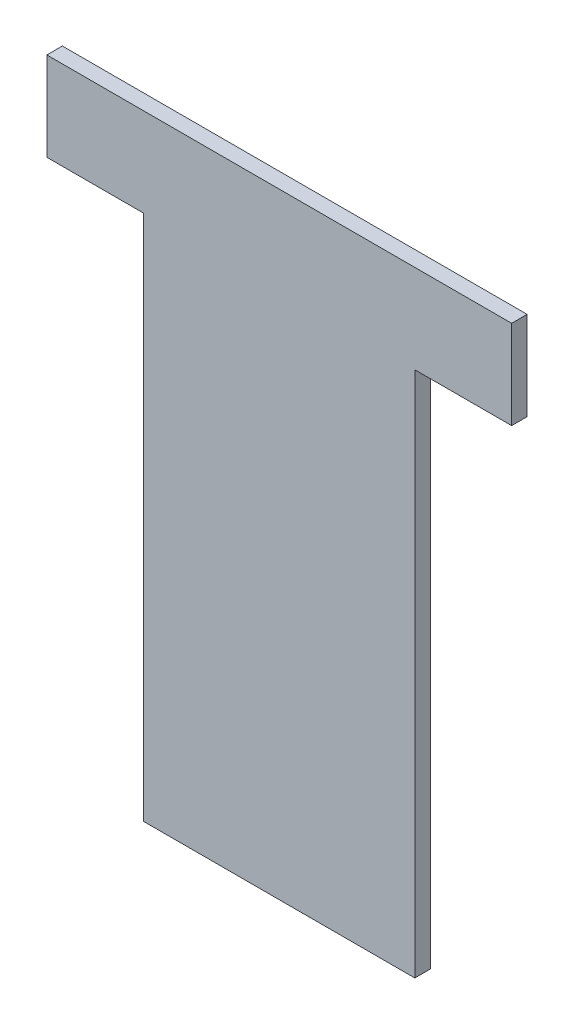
ISO-10303-21;
HEADER;
FILE_DESCRIPTION(('STEP AP214'),'2;1');
FILE_NAME('part.step','',(''),(''),'','','');
FILE_SCHEMA(('AUTOMOTIVE_DESIGN { 1 0 10303 214 1 1 1 1 }'));
ENDSEC;
DATA;
#1=APPLICATION_CONTEXT('core data for automotive mechanical design processes');
#2=APPLICATION_PROTOCOL_DEFINITION('international standard','automotive_design',2000,#1);
#3=PRODUCT_CONTEXT('',#1,'mechanical');
#4=PRODUCT('Part','Part','',(#3));
#5=PRODUCT_RELATED_PRODUCT_CATEGORY('part','',(#4));
#6=PRODUCT_DEFINITION_FORMATION('','',#4);
#7=PRODUCT_DEFINITION_CONTEXT('part definition',#1,'design');
#8=PRODUCT_DEFINITION('design','',#6,#7);
#9=PRODUCT_DEFINITION_SHAPE('','',#8);
#10=(LENGTH_UNIT() NAMED_UNIT(*) SI_UNIT(.MILLI.,.METRE.));
#11=(NAMED_UNIT(*) PLANE_ANGLE_UNIT() SI_UNIT($,.RADIAN.));
#12=(NAMED_UNIT(*) SI_UNIT($,.STERADIAN.) SOLID_ANGLE_UNIT());
#13=UNCERTAINTY_MEASURE_WITH_UNIT(LENGTH_MEASURE(1.E-05),#10,'distance_accuracy_value','');
#14=(GEOMETRIC_REPRESENTATION_CONTEXT(3) GLOBAL_UNCERTAINTY_ASSIGNED_CONTEXT((#13)) GLOBAL_UNIT_ASSIGNED_CONTEXT((#10,
#11,#12)) REPRESENTATION_CONTEXT('',''));
#15=CARTESIAN_POINT('',(0.,0.,0.));
#16=DIRECTION('',(0.,0.,1.));
#17=DIRECTION('',(1.,0.,0.));
#18=AXIS2_PLACEMENT_3D('',#15,#16,#17);
#19=CARTESIAN_POINT('',(-124.148712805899,86.4367353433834,5.));
#20=DIRECTION('',(1.,0.,0.));
#21=DIRECTION('',(0.,0.,-1.));
#22=AXIS2_PLACEMENT_3D('',#19,#20,#21);
#23=PLANE('',#22);
#24=DIRECTION('',(0.,-1.,0.));
#25=VECTOR('',#24,1.);
#26=CARTESIAN_POINT('',(-124.148712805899,86.4367353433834,0.));
#27=LINE('',#26,#25);
#28=CARTESIAN_POINT('',(-124.148712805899,115.046077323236,0.));
#29=VERTEX_POINT('',#28);
#30=CARTESIAN_POINT('',(-124.148712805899,86.4367353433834,0.));
#31=VERTEX_POINT('',#30);
#32=EDGE_CURVE('E129',#29,#31,#27,.T.);
#33=ORIENTED_EDGE('',*,*,#32,.T.);
#34=DIRECTION('',(0.,0.,-1.));
#35=VECTOR('',#34,1.);
#36=CARTESIAN_POINT('',(-124.148712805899,86.4367353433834,5.));
#37=LINE('',#36,#35);
#38=CARTESIAN_POINT('',(-124.148712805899,86.4367353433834,5.));
#39=VERTEX_POINT('',#38);
#40=EDGE_CURVE('E11',#39,#31,#37,.T.);
#41=ORIENTED_EDGE('',*,*,#40,.F.);
#42=DIRECTION('',(0.,-1.,0.));
#43=VECTOR('',#42,1.);
#44=CARTESIAN_POINT('',(-124.148712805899,86.4367353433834,5.));
#45=LINE('',#44,#43);
#46=CARTESIAN_POINT('',(-124.148712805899,115.046077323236,5.));
#47=VERTEX_POINT('',#46);
#48=EDGE_CURVE('E143',#47,#39,#45,.T.);
#49=ORIENTED_EDGE('',*,*,#48,.F.);
#50=DIRECTION('',(0.,0.,-1.));
#51=VECTOR('',#50,1.);
#52=CARTESIAN_POINT('',(-124.148712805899,115.046077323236,5.));
#53=LINE('',#52,#51);
#54=EDGE_CURVE('E125',#47,#29,#53,.T.);
#55=ORIENTED_EDGE('',*,*,#54,.T.);
#56=EDGE_LOOP('',(#33,#41,#49,#55));
#57=FACE_BOUND('',#56,.T.);
#58=ADVANCED_FACE('F33',(#57),#23,.F.);
#59=CARTESIAN_POINT('',(-92.898712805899,86.4367353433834,5.));
#60=DIRECTION('',(0.,1.,0.));
#61=DIRECTION('',(0.,0.,1.));
#62=AXIS2_PLACEMENT_3D('',#59,#60,#61);
#63=PLANE('',#62);
#64=DIRECTION('',(1.,0.,0.));
#65=VECTOR('',#64,1.);
#66=CARTESIAN_POINT('',(-92.898712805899,86.4367353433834,0.));
#67=LINE('',#66,#65);
#68=CARTESIAN_POINT('',(-92.898712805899,86.4367353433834,0.));
#69=VERTEX_POINT('',#68);
#70=EDGE_CURVE('E132',#31,#69,#67,.T.);
#71=ORIENTED_EDGE('',*,*,#70,.T.);
#72=DIRECTION('',(0.,0.,-1.));
#73=VECTOR('',#72,1.);
#74=CARTESIAN_POINT('',(-92.898712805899,86.4367353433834,5.));
#75=LINE('',#74,#73);
#76=CARTESIAN_POINT('',(-92.898712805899,86.4367353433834,5.));
#77=VERTEX_POINT('',#76);
#78=EDGE_CURVE('E41',#77,#69,#75,.T.);
#79=ORIENTED_EDGE('',*,*,#78,.F.);
#80=DIRECTION('',(1.,0.,0.));
#81=VECTOR('',#80,1.);
#82=CARTESIAN_POINT('',(-92.898712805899,86.4367353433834,5.));
#83=LINE('',#82,#81);
#84=EDGE_CURVE('E92',#39,#77,#83,.T.);
#85=ORIENTED_EDGE('',*,*,#84,.F.);
#86=ORIENTED_EDGE('',*,*,#40,.T.);
#87=EDGE_LOOP('',(#71,#79,#85,#86));
#88=FACE_BOUND('',#87,.T.);
#89=ADVANCED_FACE('F178',(#88),#63,.F.);
#90=CARTESIAN_POINT('',(-92.898712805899,-83.5632646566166,5.));
#91=DIRECTION('',(1.,0.,0.));
#92=DIRECTION('',(0.,0.,-1.));
#93=AXIS2_PLACEMENT_3D('',#90,#91,#92);
#94=PLANE('',#93);
#95=DIRECTION('',(0.,-1.,0.));
#96=VECTOR('',#95,1.);
#97=CARTESIAN_POINT('',(-92.898712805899,-83.5632646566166,0.));
#98=LINE('',#97,#96);
#99=CARTESIAN_POINT('',(-92.898712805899,-83.5632646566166,0.));
#100=VERTEX_POINT('',#99);
#101=EDGE_CURVE('E134',#69,#100,#98,.T.);
#102=ORIENTED_EDGE('',*,*,#101,.T.);
#103=DIRECTION('',(0.,0.,-1.));
#104=VECTOR('',#103,1.);
#105=CARTESIAN_POINT('',(-92.898712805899,-83.5632646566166,5.));
#106=LINE('',#105,#104);
#107=CARTESIAN_POINT('',(-92.898712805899,-83.5632646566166,5.));
#108=VERTEX_POINT('',#107);
#109=EDGE_CURVE('E150',#108,#100,#106,.T.);
#110=ORIENTED_EDGE('',*,*,#109,.F.);
#111=DIRECTION('',(0.,-1.,0.));
#112=VECTOR('',#111,1.);
#113=CARTESIAN_POINT('',(-92.898712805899,-83.5632646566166,5.));
#114=LINE('',#113,#112);
#115=EDGE_CURVE('E158',#77,#108,#114,.T.);
#116=ORIENTED_EDGE('',*,*,#115,.F.);
#117=ORIENTED_EDGE('',*,*,#78,.T.);
#118=EDGE_LOOP('',(#102,#110,#116,#117));
#119=FACE_BOUND('',#118,.T.);
#120=ADVANCED_FACE('F156',(#119),#94,.F.);
#121=CARTESIAN_POINT('',(-5.39871280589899,-83.5632646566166,5.));
#122=DIRECTION('',(0.,1.,0.));
#123=DIRECTION('',(0.,0.,1.));
#124=AXIS2_PLACEMENT_3D('',#121,#122,#123);
#125=PLANE('',#124);
#126=DIRECTION('',(1.,0.,0.));
#127=VECTOR('',#126,1.);
#128=CARTESIAN_POINT('',(-5.39871280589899,-83.5632646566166,0.));
#129=LINE('',#128,#127);
#130=CARTESIAN_POINT('',(-5.39871280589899,-83.5632646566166,0.));
#131=VERTEX_POINT('',#130);
#132=EDGE_CURVE('E136',#100,#131,#129,.T.);
#133=ORIENTED_EDGE('',*,*,#132,.T.);
#134=DIRECTION('',(0.,0.,-1.));
#135=VECTOR('',#134,1.);
#136=CARTESIAN_POINT('',(-5.39871280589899,-83.5632646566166,5.));
#137=LINE('',#136,#135);
#138=CARTESIAN_POINT('',(-5.39871280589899,-83.5632646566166,5.));
#139=VERTEX_POINT('',#138);
#140=EDGE_CURVE('E147',#139,#131,#137,.T.);
#141=ORIENTED_EDGE('',*,*,#140,.F.);
#142=DIRECTION('',(1.,0.,0.));
#143=VECTOR('',#142,1.);
#144=CARTESIAN_POINT('',(-5.39871280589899,-83.5632646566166,5.));
#145=LINE('',#144,#143);
#146=EDGE_CURVE('E170',#108,#139,#145,.T.);
#147=ORIENTED_EDGE('',*,*,#146,.F.);
#148=ORIENTED_EDGE('',*,*,#109,.T.);
#149=EDGE_LOOP('',(#133,#141,#147,#148));
#150=FACE_BOUND('',#149,.T.);
#151=ADVANCED_FACE('F166',(#150),#125,.F.);
#152=CARTESIAN_POINT('',(-5.39871280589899,86.4367353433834,5.));
#153=DIRECTION('',(-1.,0.,0.));
#154=DIRECTION('',(0.,-1.,0.));
#155=AXIS2_PLACEMENT_3D('',#152,#153,#154);
#156=PLANE('',#155);
#157=DIRECTION('',(0.,1.,0.));
#158=VECTOR('',#157,1.);
#159=CARTESIAN_POINT('',(-5.39871280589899,86.4367353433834,0.));
#160=LINE('',#159,#158);
#161=CARTESIAN_POINT('',(-5.39871280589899,86.4367353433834,0.));
#162=VERTEX_POINT('',#161);
#163=EDGE_CURVE('E138',#131,#162,#160,.T.);
#164=ORIENTED_EDGE('',*,*,#163,.T.);
#165=DIRECTION('',(0.,0.,-1.));
#166=VECTOR('',#165,1.);
#167=CARTESIAN_POINT('',(-5.39871280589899,86.4367353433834,5.));
#168=LINE('',#167,#166);
#169=CARTESIAN_POINT('',(-5.39871280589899,86.4367353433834,5.));
#170=VERTEX_POINT('',#169);
#171=EDGE_CURVE('E120',#170,#162,#168,.T.);
#172=ORIENTED_EDGE('',*,*,#171,.F.);
#173=DIRECTION('',(0.,1.,0.));
#174=VECTOR('',#173,1.);
#175=CARTESIAN_POINT('',(-5.39871280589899,86.4367353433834,5.));
#176=LINE('',#175,#174);
#177=EDGE_CURVE('E111',#139,#170,#176,.T.);
#178=ORIENTED_EDGE('',*,*,#177,.F.);
#179=ORIENTED_EDGE('',*,*,#140,.T.);
#180=EDGE_LOOP('',(#164,#172,#178,#179));
#181=FACE_BOUND('',#180,.T.);
#182=ADVANCED_FACE('F169',(#181),#156,.F.);
#183=CARTESIAN_POINT('',(25.851287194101,86.4367353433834,5.));
#184=DIRECTION('',(0.,1.,0.));
#185=DIRECTION('',(0.,0.,1.));
#186=AXIS2_PLACEMENT_3D('',#183,#184,#185);
#187=PLANE('',#186);
#188=DIRECTION('',(1.,0.,0.));
#189=VECTOR('',#188,1.);
#190=CARTESIAN_POINT('',(25.851287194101,86.4367353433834,0.));
#191=LINE('',#190,#189);
#192=CARTESIAN_POINT('',(25.851287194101,86.4367353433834,0.));
#193=VERTEX_POINT('',#192);
#194=EDGE_CURVE('E119',#162,#193,#191,.T.);
#195=ORIENTED_EDGE('',*,*,#194,.T.);
#196=DIRECTION('',(0.,0.,-1.));
#197=VECTOR('',#196,1.);
#198=CARTESIAN_POINT('',(25.851287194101,86.4367353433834,5.));
#199=LINE('',#198,#197);
#200=CARTESIAN_POINT('',(25.851287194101,86.4367353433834,5.));
#201=VERTEX_POINT('',#200);
#202=EDGE_CURVE('E116',#201,#193,#199,.T.);
#203=ORIENTED_EDGE('',*,*,#202,.F.);
#204=DIRECTION('',(1.,0.,0.));
#205=VECTOR('',#204,1.);
#206=CARTESIAN_POINT('',(25.851287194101,86.4367353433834,5.));
#207=LINE('',#206,#205);
#208=EDGE_CURVE('E105',#170,#201,#207,.T.);
#209=ORIENTED_EDGE('',*,*,#208,.F.);
#210=ORIENTED_EDGE('',*,*,#171,.T.);
#211=EDGE_LOOP('',(#195,#203,#209,#210));
#212=FACE_BOUND('',#211,.T.);
#213=ADVANCED_FACE('F117',(#212),#187,.F.);
#214=CARTESIAN_POINT('',(25.851287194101,115.046077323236,5.));
#215=DIRECTION('',(-1.,0.,0.));
#216=DIRECTION('',(0.,-1.,0.));
#217=AXIS2_PLACEMENT_3D('',#214,#215,#216);
#218=PLANE('',#217);
#219=DIRECTION('',(0.,1.,0.));
#220=VECTOR('',#219,1.);
#221=CARTESIAN_POINT('',(25.851287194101,115.046077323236,0.));
#222=LINE('',#221,#220);
#223=CARTESIAN_POINT('',(25.851287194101,115.046077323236,0.));
#224=VERTEX_POINT('',#223);
#225=EDGE_CURVE('E78',#193,#224,#222,.T.);
#226=ORIENTED_EDGE('',*,*,#225,.T.);
#227=DIRECTION('',(0.,0.,-1.));
#228=VECTOR('',#227,1.);
#229=CARTESIAN_POINT('',(25.851287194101,115.046077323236,5.));
#230=LINE('',#229,#228);
#231=CARTESIAN_POINT('',(25.851287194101,115.046077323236,5.));
#232=VERTEX_POINT('',#231);
#233=EDGE_CURVE('E121',#232,#224,#230,.T.);
#234=ORIENTED_EDGE('',*,*,#233,.F.);
#235=DIRECTION('',(0.,1.,0.));
#236=VECTOR('',#235,1.);
#237=CARTESIAN_POINT('',(25.851287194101,115.046077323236,5.));
#238=LINE('',#237,#236);
#239=EDGE_CURVE('E109',#201,#232,#238,.T.);
#240=ORIENTED_EDGE('',*,*,#239,.F.);
#241=ORIENTED_EDGE('',*,*,#202,.T.);
#242=EDGE_LOOP('',(#226,#234,#240,#241));
#243=FACE_BOUND('',#242,.T.);
#244=ADVANCED_FACE('F123',(#243),#218,.F.);
#245=CARTESIAN_POINT('',(-124.148712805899,115.046077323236,5.));
#246=DIRECTION('',(0.,-1.,0.));
#247=DIRECTION('',(0.,0.,-1.));
#248=AXIS2_PLACEMENT_3D('',#245,#246,#247);
#249=PLANE('',#248);
#250=DIRECTION('',(-1.,0.,0.));
#251=VECTOR('',#250,1.);
#252=CARTESIAN_POINT('',(-124.148712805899,115.046077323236,0.));
#253=LINE('',#252,#251);
#254=EDGE_CURVE('E84',#224,#29,#253,.T.);
#255=ORIENTED_EDGE('',*,*,#254,.T.);
#256=ORIENTED_EDGE('',*,*,#54,.F.);
#257=DIRECTION('',(-1.,0.,0.));
#258=VECTOR('',#257,1.);
#259=CARTESIAN_POINT('',(-124.148712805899,115.046077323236,5.));
#260=LINE('',#259,#258);
#261=EDGE_CURVE('E49',#232,#47,#260,.T.);
#262=ORIENTED_EDGE('',*,*,#261,.F.);
#263=ORIENTED_EDGE('',*,*,#233,.T.);
#264=EDGE_LOOP('',(#255,#256,#262,#263));
#265=FACE_BOUND('',#264,.T.);
#266=ADVANCED_FACE('F194',(#265),#249,.F.);
#267=CARTESIAN_POINT('',(0.,0.,5.));
#268=DIRECTION('',(0.,0.,-1.));
#269=DIRECTION('',(-1.,0.,0.));
#270=AXIS2_PLACEMENT_3D('',#267,#268,#269);
#271=PLANE('',#270);
#272=ORIENTED_EDGE('',*,*,#48,.T.);
#273=ORIENTED_EDGE('',*,*,#84,.T.);
#274=ORIENTED_EDGE('',*,*,#115,.T.);
#275=ORIENTED_EDGE('',*,*,#146,.T.);
#276=ORIENTED_EDGE('',*,*,#177,.T.);
#277=ORIENTED_EDGE('',*,*,#208,.T.);
#278=ORIENTED_EDGE('',*,*,#239,.T.);
#279=ORIENTED_EDGE('',*,*,#261,.T.);
#280=EDGE_LOOP('',(#272,#273,#274,#275,#276,#277,#278,#279));
#281=FACE_BOUND('',#280,.T.);
#282=ADVANCED_FACE('F107',(#281),#271,.F.);
#283=CARTESIAN_POINT('',(0.,0.,0.));
#284=DIRECTION('',(0.,0.,-1.));
#285=DIRECTION('',(-1.,0.,0.));
#286=AXIS2_PLACEMENT_3D('',#283,#284,#285);
#287=PLANE('',#286);
#288=ORIENTED_EDGE('',*,*,#32,.F.);
#289=ORIENTED_EDGE('',*,*,#254,.F.);
#290=ORIENTED_EDGE('',*,*,#225,.F.);
#291=ORIENTED_EDGE('',*,*,#194,.F.);
#292=ORIENTED_EDGE('',*,*,#163,.F.);
#293=ORIENTED_EDGE('',*,*,#132,.F.);
#294=ORIENTED_EDGE('',*,*,#101,.F.);
#295=ORIENTED_EDGE('',*,*,#70,.F.);
#296=EDGE_LOOP('',(#288,#289,#290,#291,#292,#293,#294,#295));
#297=FACE_BOUND('',#296,.T.);
#298=ADVANCED_FACE('F162',(#297),#287,.T.);
#299=CLOSED_SHELL('',(#58,#89,#120,#151,#182,#213,#244,#266,#282,#298));
#300=MANIFOLD_SOLID_BREP('B2',#299);
#301=ADVANCED_BREP_SHAPE_REPRESENTATION('',(#18,#300),#14);
#302=SHAPE_DEFINITION_REPRESENTATION(#9,#301);
ENDSEC;
END-ISO-10303-21;
